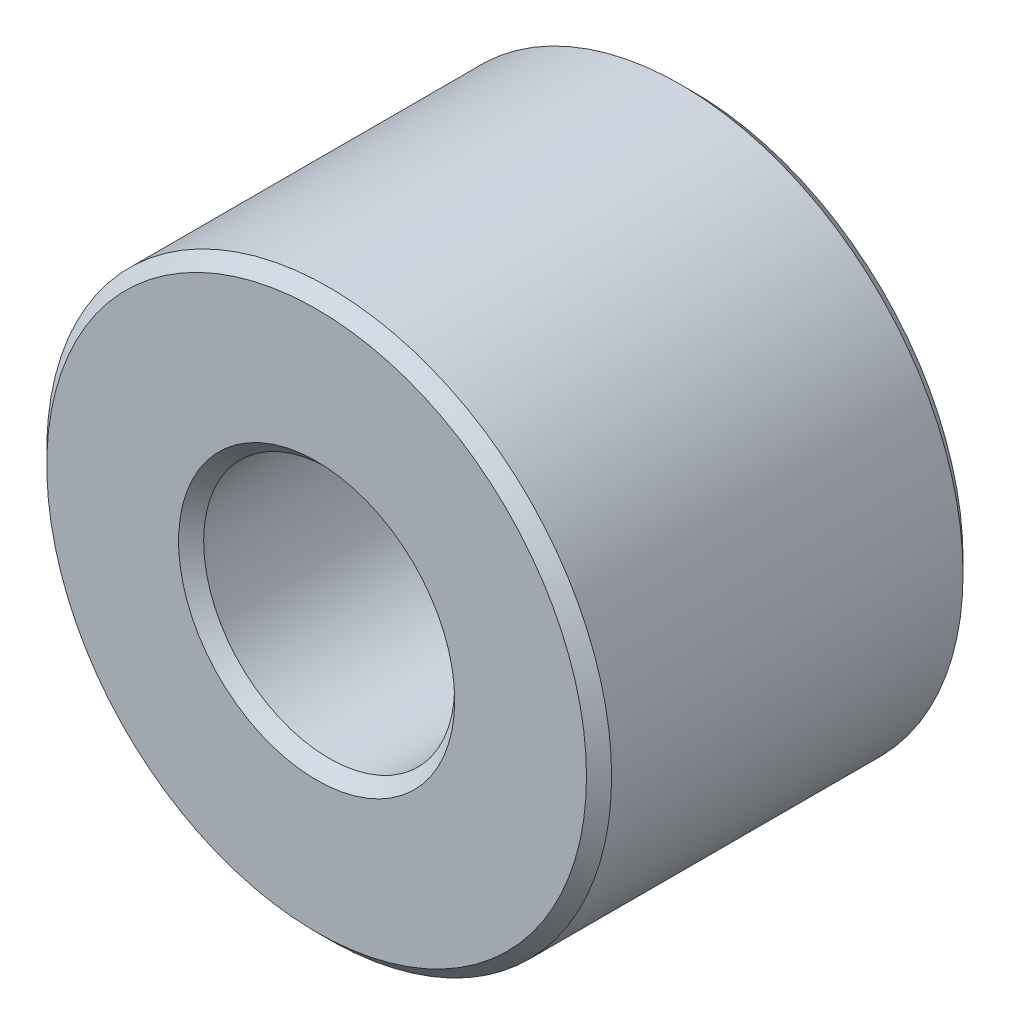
from build123d import *

# Parameters (mm, degrees)
SKETCH1_R           = 9
SKETCH1_R_2         = 4
BOSS_EXTRUDE1_DEPTH = 6
CHAMFER1_SIZE       = 0.4


with BuildPart() as part:
    # Sketch1 → Boss-Extrude1 (new, symmetric)
    with BuildSketch(Plane.XY):
        Circle(SKETCH1_R)
        Circle(SKETCH1_R_2, mode=Mode.SUBTRACT)
    extrude(amount=BOSS_EXTRUDE1_DEPTH, both=True)

    # Chamfer1
    chamfer1_edges = [part.edges().sort_by_distance(p)[0] for p in [
        (-9, 0, -6),
        (-9, 0, 6),
        (-4, 0, -6),
        (-4, 0, 6),
    ]]
    chamfer(chamfer1_edges, length=CHAMFER1_SIZE)


solid = part.part
